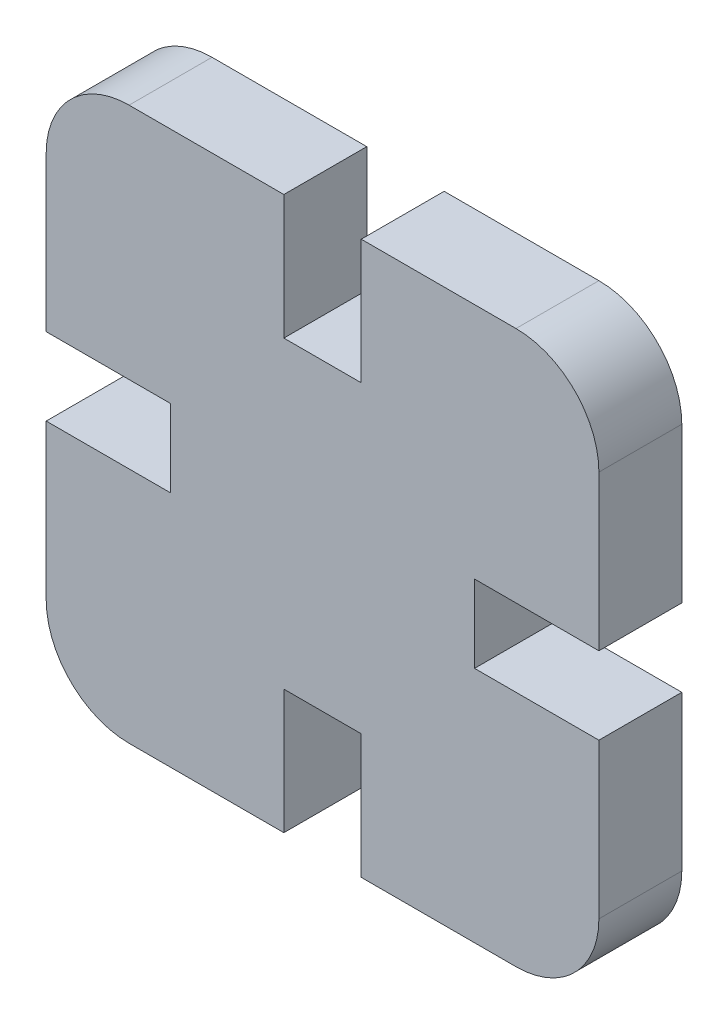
ISO-10303-21;
HEADER;
FILE_DESCRIPTION(('STEP AP214'),'2;1');
FILE_NAME('part.step','',(''),(''),'','','');
FILE_SCHEMA(('AUTOMOTIVE_DESIGN { 1 0 10303 214 1 1 1 1 }'));
ENDSEC;
DATA;
#1=APPLICATION_CONTEXT('core data for automotive mechanical design processes');
#2=APPLICATION_PROTOCOL_DEFINITION('international standard','automotive_design',2000,#1);
#3=PRODUCT_CONTEXT('',#1,'mechanical');
#4=PRODUCT('Part','Part','',(#3));
#5=PRODUCT_RELATED_PRODUCT_CATEGORY('part','',(#4));
#6=PRODUCT_DEFINITION_FORMATION('','',#4);
#7=PRODUCT_DEFINITION_CONTEXT('part definition',#1,'design');
#8=PRODUCT_DEFINITION('design','',#6,#7);
#9=PRODUCT_DEFINITION_SHAPE('','',#8);
#10=(LENGTH_UNIT() NAMED_UNIT(*) SI_UNIT(.MILLI.,.METRE.));
#11=(NAMED_UNIT(*) PLANE_ANGLE_UNIT() SI_UNIT($,.RADIAN.));
#12=(NAMED_UNIT(*) SI_UNIT($,.STERADIAN.) SOLID_ANGLE_UNIT());
#13=UNCERTAINTY_MEASURE_WITH_UNIT(LENGTH_MEASURE(1.E-05),#10,'distance_accuracy_value','');
#14=(GEOMETRIC_REPRESENTATION_CONTEXT(3) GLOBAL_UNCERTAINTY_ASSIGNED_CONTEXT((#13)) GLOBAL_UNIT_ASSIGNED_CONTEXT((#10,
#11,#12)) REPRESENTATION_CONTEXT('',''));
#15=CARTESIAN_POINT('',(0.,0.,0.));
#16=DIRECTION('',(0.,0.,1.));
#17=DIRECTION('',(1.,0.,0.));
#18=AXIS2_PLACEMENT_3D('',#15,#16,#17);
#19=CARTESIAN_POINT('',(-7.,-6.99999999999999,3.));
#20=DIRECTION('',(0.,0.,-1.));
#21=DIRECTION('',(-1.,0.,0.));
#22=AXIS2_PLACEMENT_3D('',#19,#20,#21);
#23=CYLINDRICAL_SURFACE('',#22,3.);
#24=CARTESIAN_POINT('',(-7.,-6.99999999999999,0.));
#25=DIRECTION('',(0.,0.,1.));
#26=DIRECTION('',(1.,0.,0.));
#27=AXIS2_PLACEMENT_3D('',#24,#25,#26);
#28=CIRCLE('',#27,3.);
#29=CARTESIAN_POINT('',(-10.,-6.99999999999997,0.));
#30=VERTEX_POINT('',#29);
#31=CARTESIAN_POINT('',(-6.99999999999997,-9.99999999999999,0.));
#32=VERTEX_POINT('',#31);
#33=EDGE_CURVE('E224',#30,#32,#28,.T.);
#34=ORIENTED_EDGE('',*,*,#33,.T.);
#35=DIRECTION('',(0.,0.,-1.));
#36=VECTOR('',#35,1.);
#37=CARTESIAN_POINT('',(-6.99999999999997,-9.99999999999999,3.));
#38=LINE('',#37,#36);
#39=CARTESIAN_POINT('',(-6.99999999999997,-9.99999999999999,3.));
#40=VERTEX_POINT('',#39);
#41=EDGE_CURVE('E11',#40,#32,#38,.T.);
#42=ORIENTED_EDGE('',*,*,#41,.F.);
#43=CARTESIAN_POINT('',(-7.,-6.99999999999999,3.));
#44=DIRECTION('',(0.,0.,1.));
#45=DIRECTION('',(1.,0.,0.));
#46=AXIS2_PLACEMENT_3D('',#43,#44,#45);
#47=CIRCLE('',#46,3.);
#48=CARTESIAN_POINT('',(-10.,-6.99999999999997,3.));
#49=VERTEX_POINT('',#48);
#50=EDGE_CURVE('E270',#49,#40,#47,.T.);
#51=ORIENTED_EDGE('',*,*,#50,.F.);
#52=DIRECTION('',(0.,0.,-1.));
#53=VECTOR('',#52,1.);
#54=CARTESIAN_POINT('',(-10.,-6.99999999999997,3.));
#55=LINE('',#54,#53);
#56=EDGE_CURVE('E220',#49,#30,#55,.T.);
#57=ORIENTED_EDGE('',*,*,#56,.T.);
#58=EDGE_LOOP('',(#34,#42,#51,#57));
#59=FACE_BOUND('',#58,.T.);
#60=ADVANCED_FACE('F32',(#59),#23,.T.);
#61=CARTESIAN_POINT('',(-6.99999999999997,-9.99999999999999,3.));
#62=DIRECTION('',(0.,1.,0.));
#63=DIRECTION('',(-1.,0.,0.));
#64=AXIS2_PLACEMENT_3D('',#61,#62,#63);
#65=PLANE('',#64);
#66=DIRECTION('',(1.,0.,0.));
#67=VECTOR('',#66,1.);
#68=CARTESIAN_POINT('',(-6.99999999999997,-9.99999999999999,0.));
#69=LINE('',#68,#67);
#70=CARTESIAN_POINT('',(-1.39999999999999,-10.,0.));
#71=VERTEX_POINT('',#70);
#72=EDGE_CURVE('E227',#32,#71,#69,.T.);
#73=ORIENTED_EDGE('',*,*,#72,.T.);
#74=DIRECTION('',(0.,0.,-1.));
#75=VECTOR('',#74,1.);
#76=CARTESIAN_POINT('',(-1.39999999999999,-10.,3.));
#77=LINE('',#76,#75);
#78=CARTESIAN_POINT('',(-1.39999999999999,-10.,3.));
#79=VERTEX_POINT('',#78);
#80=EDGE_CURVE('E40',#79,#71,#77,.T.);
#81=ORIENTED_EDGE('',*,*,#80,.F.);
#82=DIRECTION('',(1.,0.,0.));
#83=VECTOR('',#82,1.);
#84=CARTESIAN_POINT('',(-6.99999999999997,-9.99999999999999,3.));
#85=LINE('',#84,#83);
#86=EDGE_CURVE('E139',#40,#79,#85,.T.);
#87=ORIENTED_EDGE('',*,*,#86,.F.);
#88=ORIENTED_EDGE('',*,*,#41,.T.);
#89=EDGE_LOOP('',(#73,#81,#87,#88));
#90=FACE_BOUND('',#89,.T.);
#91=ADVANCED_FACE('F408',(#90),#65,.F.);
#92=CARTESIAN_POINT('',(-1.39999999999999,-10.,3.));
#93=DIRECTION('',(-1.,0.,0.));
#94=DIRECTION('',(0.,-1.,0.));
#95=AXIS2_PLACEMENT_3D('',#92,#93,#94);
#96=PLANE('',#95);
#97=DIRECTION('',(0.,1.,0.));
#98=VECTOR('',#97,1.);
#99=CARTESIAN_POINT('',(-1.39999999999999,-10.,0.));
#100=LINE('',#99,#98);
#101=CARTESIAN_POINT('',(-1.39999999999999,-5.5,0.));
#102=VERTEX_POINT('',#101);
#103=EDGE_CURVE('E229',#71,#102,#100,.T.);
#104=ORIENTED_EDGE('',*,*,#103,.T.);
#105=DIRECTION('',(0.,0.,-1.));
#106=VECTOR('',#105,1.);
#107=CARTESIAN_POINT('',(-1.39999999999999,-5.5,3.));
#108=LINE('',#107,#106);
#109=CARTESIAN_POINT('',(-1.39999999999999,-5.5,3.));
#110=VERTEX_POINT('',#109);
#111=EDGE_CURVE('E325',#110,#102,#108,.T.);
#112=ORIENTED_EDGE('',*,*,#111,.F.);
#113=DIRECTION('',(0.,1.,0.));
#114=VECTOR('',#113,1.);
#115=CARTESIAN_POINT('',(-1.39999999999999,-10.,3.));
#116=LINE('',#115,#114);
#117=EDGE_CURVE('E333',#79,#110,#116,.T.);
#118=ORIENTED_EDGE('',*,*,#117,.F.);
#119=ORIENTED_EDGE('',*,*,#80,.T.);
#120=EDGE_LOOP('',(#104,#112,#118,#119));
#121=FACE_BOUND('',#120,.T.);
#122=ADVANCED_FACE('F331',(#121),#96,.F.);
#123=CARTESIAN_POINT('',(-1.39999999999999,-5.5,3.));
#124=DIRECTION('',(0.,1.,0.));
#125=DIRECTION('',(0.,0.,1.));
#126=AXIS2_PLACEMENT_3D('',#123,#124,#125);
#127=PLANE('',#126);
#128=DIRECTION('',(1.,0.,0.));
#129=VECTOR('',#128,1.);
#130=CARTESIAN_POINT('',(-1.39999999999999,-5.5,0.));
#131=LINE('',#130,#129);
#132=CARTESIAN_POINT('',(1.40000000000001,-5.5,0.));
#133=VERTEX_POINT('',#132);
#134=EDGE_CURVE('E231',#102,#133,#131,.T.);
#135=ORIENTED_EDGE('',*,*,#134,.T.);
#136=DIRECTION('',(0.,0.,-1.));
#137=VECTOR('',#136,1.);
#138=CARTESIAN_POINT('',(1.40000000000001,-5.5,3.));
#139=LINE('',#138,#137);
#140=CARTESIAN_POINT('',(1.40000000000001,-5.5,3.));
#141=VERTEX_POINT('',#140);
#142=EDGE_CURVE('E322',#141,#133,#139,.T.);
#143=ORIENTED_EDGE('',*,*,#142,.F.);
#144=DIRECTION('',(1.,0.,0.));
#145=VECTOR('',#144,1.);
#146=CARTESIAN_POINT('',(-1.39999999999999,-5.5,3.));
#147=LINE('',#146,#145);
#148=EDGE_CURVE('E351',#110,#141,#147,.T.);
#149=ORIENTED_EDGE('',*,*,#148,.F.);
#150=ORIENTED_EDGE('',*,*,#111,.T.);
#151=EDGE_LOOP('',(#135,#143,#149,#150));
#152=FACE_BOUND('',#151,.T.);
#153=ADVANCED_FACE('F342',(#152),#127,.F.);
#154=CARTESIAN_POINT('',(1.40000000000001,-5.5,3.));
#155=DIRECTION('',(1.,0.,0.));
#156=DIRECTION('',(0.,1.,0.));
#157=AXIS2_PLACEMENT_3D('',#154,#155,#156);
#158=PLANE('',#157);
#159=DIRECTION('',(0.,-1.,0.));
#160=VECTOR('',#159,1.);
#161=CARTESIAN_POINT('',(1.40000000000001,-5.5,0.));
#162=LINE('',#161,#160);
#163=CARTESIAN_POINT('',(1.4,-10.,0.));
#164=VERTEX_POINT('',#163);
#165=EDGE_CURVE('E233',#133,#164,#162,.T.);
#166=ORIENTED_EDGE('',*,*,#165,.T.);
#167=DIRECTION('',(0.,0.,-1.));
#168=VECTOR('',#167,1.);
#169=CARTESIAN_POINT('',(1.4,-10.,3.));
#170=LINE('',#169,#168);
#171=CARTESIAN_POINT('',(1.4,-10.,3.));
#172=VERTEX_POINT('',#171);
#173=EDGE_CURVE('E319',#172,#164,#170,.T.);
#174=ORIENTED_EDGE('',*,*,#173,.F.);
#175=DIRECTION('',(0.,-1.,0.));
#176=VECTOR('',#175,1.);
#177=CARTESIAN_POINT('',(1.40000000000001,-5.5,3.));
#178=LINE('',#177,#176);
#179=EDGE_CURVE('E348',#141,#172,#178,.T.);
#180=ORIENTED_EDGE('',*,*,#179,.F.);
#181=ORIENTED_EDGE('',*,*,#142,.T.);
#182=EDGE_LOOP('',(#166,#174,#180,#181));
#183=FACE_BOUND('',#182,.T.);
#184=ADVANCED_FACE('F346',(#183),#158,.F.);
#185=CARTESIAN_POINT('',(1.4,-10.,3.));
#186=DIRECTION('',(0.,1.,0.));
#187=DIRECTION('',(-1.,0.,0.));
#188=AXIS2_PLACEMENT_3D('',#185,#186,#187);
#189=PLANE('',#188);
#190=DIRECTION('',(1.,0.,0.));
#191=VECTOR('',#190,1.);
#192=CARTESIAN_POINT('',(1.4,-10.,0.));
#193=LINE('',#192,#191);
#194=CARTESIAN_POINT('',(6.99999999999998,-10.,0.));
#195=VERTEX_POINT('',#194);
#196=EDGE_CURVE('E235',#164,#195,#193,.T.);
#197=ORIENTED_EDGE('',*,*,#196,.T.);
#198=DIRECTION('',(0.,0.,-1.));
#199=VECTOR('',#198,1.);
#200=CARTESIAN_POINT('',(6.99999999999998,-10.,3.));
#201=LINE('',#200,#199);
#202=CARTESIAN_POINT('',(6.99999999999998,-10.,3.));
#203=VERTEX_POINT('',#202);
#204=EDGE_CURVE('E316',#203,#195,#201,.T.);
#205=ORIENTED_EDGE('',*,*,#204,.F.);
#206=DIRECTION('',(1.,0.,0.));
#207=VECTOR('',#206,1.);
#208=CARTESIAN_POINT('',(1.4,-10.,3.));
#209=LINE('',#208,#207);
#210=EDGE_CURVE('E350',#172,#203,#209,.T.);
#211=ORIENTED_EDGE('',*,*,#210,.F.);
#212=ORIENTED_EDGE('',*,*,#173,.T.);
#213=EDGE_LOOP('',(#197,#205,#211,#212));
#214=FACE_BOUND('',#213,.T.);
#215=ADVANCED_FACE('F421',(#214),#189,.F.);
#216=CARTESIAN_POINT('',(7.,-7.00000000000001,3.));
#217=DIRECTION('',(0.,0.,-1.));
#218=DIRECTION('',(-1.,0.,0.));
#219=AXIS2_PLACEMENT_3D('',#216,#217,#218);
#220=CYLINDRICAL_SURFACE('',#219,3.);
#221=CARTESIAN_POINT('',(7.,-7.00000000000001,0.));
#222=DIRECTION('',(0.,0.,1.));
#223=DIRECTION('',(1.,0.,0.));
#224=AXIS2_PLACEMENT_3D('',#221,#222,#223);
#225=CIRCLE('',#224,3.);
#226=CARTESIAN_POINT('',(9.99999999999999,-6.99999999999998,0.));
#227=VERTEX_POINT('',#226);
#228=EDGE_CURVE('E237',#195,#227,#225,.T.);
#229=ORIENTED_EDGE('',*,*,#228,.T.);
#230=DIRECTION('',(0.,0.,-1.));
#231=VECTOR('',#230,1.);
#232=CARTESIAN_POINT('',(9.99999999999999,-6.99999999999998,3.));
#233=LINE('',#232,#231);
#234=CARTESIAN_POINT('',(9.99999999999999,-6.99999999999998,3.));
#235=VERTEX_POINT('',#234);
#236=EDGE_CURVE('E313',#235,#227,#233,.T.);
#237=ORIENTED_EDGE('',*,*,#236,.F.);
#238=CARTESIAN_POINT('',(7.,-7.00000000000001,3.));
#239=DIRECTION('',(0.,0.,1.));
#240=DIRECTION('',(1.,0.,0.));
#241=AXIS2_PLACEMENT_3D('',#238,#239,#240);
#242=CIRCLE('',#241,3.);
#243=EDGE_CURVE('E353',#203,#235,#242,.T.);
#244=ORIENTED_EDGE('',*,*,#243,.F.);
#245=ORIENTED_EDGE('',*,*,#204,.T.);
#246=EDGE_LOOP('',(#229,#237,#244,#245));
#247=FACE_BOUND('',#246,.T.);
#248=ADVANCED_FACE('F424',(#247),#220,.T.);
#249=CARTESIAN_POINT('',(9.99999999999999,-6.99999999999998,3.));
#250=DIRECTION('',(-1.,0.,0.));
#251=DIRECTION('',(0.,-1.,0.));
#252=AXIS2_PLACEMENT_3D('',#249,#250,#251);
#253=PLANE('',#252);
#254=DIRECTION('',(0.,1.,0.));
#255=VECTOR('',#254,1.);
#256=CARTESIAN_POINT('',(9.99999999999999,-6.99999999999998,0.));
#257=LINE('',#256,#255);
#258=CARTESIAN_POINT('',(10.,-1.39999999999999,0.));
#259=VERTEX_POINT('',#258);
#260=EDGE_CURVE('E239',#227,#259,#257,.T.);
#261=ORIENTED_EDGE('',*,*,#260,.T.);
#262=DIRECTION('',(0.,0.,-1.));
#263=VECTOR('',#262,1.);
#264=CARTESIAN_POINT('',(10.,-1.39999999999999,3.));
#265=LINE('',#264,#263);
#266=CARTESIAN_POINT('',(10.,-1.39999999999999,3.));
#267=VERTEX_POINT('',#266);
#268=EDGE_CURVE('E310',#267,#259,#265,.T.);
#269=ORIENTED_EDGE('',*,*,#268,.F.);
#270=DIRECTION('',(0.,1.,0.));
#271=VECTOR('',#270,1.);
#272=CARTESIAN_POINT('',(9.99999999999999,-6.99999999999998,3.));
#273=LINE('',#272,#271);
#274=EDGE_CURVE('E359',#235,#267,#273,.T.);
#275=ORIENTED_EDGE('',*,*,#274,.F.);
#276=ORIENTED_EDGE('',*,*,#236,.T.);
#277=EDGE_LOOP('',(#261,#269,#275,#276));
#278=FACE_BOUND('',#277,.T.);
#279=ADVANCED_FACE('F428',(#278),#253,.F.);
#280=CARTESIAN_POINT('',(10.,-1.39999999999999,3.));
#281=DIRECTION('',(0.,-1.,0.));
#282=DIRECTION('',(1.,0.,0.));
#283=AXIS2_PLACEMENT_3D('',#280,#281,#282);
#284=PLANE('',#283);
#285=DIRECTION('',(-1.,0.,0.));
#286=VECTOR('',#285,1.);
#287=CARTESIAN_POINT('',(10.,-1.39999999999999,0.));
#288=LINE('',#287,#286);
#289=CARTESIAN_POINT('',(5.5,-1.39999999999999,0.));
#290=VERTEX_POINT('',#289);
#291=EDGE_CURVE('E241',#259,#290,#288,.T.);
#292=ORIENTED_EDGE('',*,*,#291,.T.);
#293=DIRECTION('',(0.,0.,-1.));
#294=VECTOR('',#293,1.);
#295=CARTESIAN_POINT('',(5.5,-1.39999999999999,3.));
#296=LINE('',#295,#294);
#297=CARTESIAN_POINT('',(5.5,-1.39999999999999,3.));
#298=VERTEX_POINT('',#297);
#299=EDGE_CURVE('E307',#298,#290,#296,.T.);
#300=ORIENTED_EDGE('',*,*,#299,.F.);
#301=DIRECTION('',(-1.,0.,0.));
#302=VECTOR('',#301,1.);
#303=CARTESIAN_POINT('',(10.,-1.39999999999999,3.));
#304=LINE('',#303,#302);
#305=EDGE_CURVE('E361',#267,#298,#304,.T.);
#306=ORIENTED_EDGE('',*,*,#305,.F.);
#307=ORIENTED_EDGE('',*,*,#268,.T.);
#308=EDGE_LOOP('',(#292,#300,#306,#307));
#309=FACE_BOUND('',#308,.T.);
#310=ADVANCED_FACE('F432',(#309),#284,.F.);
#311=CARTESIAN_POINT('',(5.5,-1.39999999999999,3.));
#312=DIRECTION('',(-1.,0.,0.));
#313=DIRECTION('',(0.,0.,1.));
#314=AXIS2_PLACEMENT_3D('',#311,#312,#313);
#315=PLANE('',#314);
#316=DIRECTION('',(0.,1.,0.));
#317=VECTOR('',#316,1.);
#318=CARTESIAN_POINT('',(5.5,-1.39999999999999,0.));
#319=LINE('',#318,#317);
#320=CARTESIAN_POINT('',(5.5,1.40000000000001,0.));
#321=VERTEX_POINT('',#320);
#322=EDGE_CURVE('E243',#290,#321,#319,.T.);
#323=ORIENTED_EDGE('',*,*,#322,.T.);
#324=DIRECTION('',(0.,0.,-1.));
#325=VECTOR('',#324,1.);
#326=CARTESIAN_POINT('',(5.5,1.40000000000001,3.));
#327=LINE('',#326,#325);
#328=CARTESIAN_POINT('',(5.5,1.40000000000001,3.));
#329=VERTEX_POINT('',#328);
#330=EDGE_CURVE('E304',#329,#321,#327,.T.);
#331=ORIENTED_EDGE('',*,*,#330,.F.);
#332=DIRECTION('',(0.,1.,0.));
#333=VECTOR('',#332,1.);
#334=CARTESIAN_POINT('',(5.5,-1.39999999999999,3.));
#335=LINE('',#334,#333);
#336=EDGE_CURVE('E363',#298,#329,#335,.T.);
#337=ORIENTED_EDGE('',*,*,#336,.F.);
#338=ORIENTED_EDGE('',*,*,#299,.T.);
#339=EDGE_LOOP('',(#323,#331,#337,#338));
#340=FACE_BOUND('',#339,.T.);
#341=ADVANCED_FACE('F436',(#340),#315,.F.);
#342=CARTESIAN_POINT('',(5.5,1.40000000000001,3.));
#343=DIRECTION('',(0.,1.,0.));
#344=DIRECTION('',(-1.,0.,0.));
#345=AXIS2_PLACEMENT_3D('',#342,#343,#344);
#346=PLANE('',#345);
#347=DIRECTION('',(1.,0.,0.));
#348=VECTOR('',#347,1.);
#349=CARTESIAN_POINT('',(5.5,1.40000000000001,0.));
#350=LINE('',#349,#348);
#351=CARTESIAN_POINT('',(10.,1.40000000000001,0.));
#352=VERTEX_POINT('',#351);
#353=EDGE_CURVE('E245',#321,#352,#350,.T.);
#354=ORIENTED_EDGE('',*,*,#353,.T.);
#355=DIRECTION('',(0.,0.,-1.));
#356=VECTOR('',#355,1.);
#357=CARTESIAN_POINT('',(10.,1.40000000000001,3.));
#358=LINE('',#357,#356);
#359=CARTESIAN_POINT('',(10.,1.40000000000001,3.));
#360=VERTEX_POINT('',#359);
#361=EDGE_CURVE('E301',#360,#352,#358,.T.);
#362=ORIENTED_EDGE('',*,*,#361,.F.);
#363=DIRECTION('',(1.,0.,0.));
#364=VECTOR('',#363,1.);
#365=CARTESIAN_POINT('',(5.5,1.40000000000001,3.));
#366=LINE('',#365,#364);
#367=EDGE_CURVE('E365',#329,#360,#366,.T.);
#368=ORIENTED_EDGE('',*,*,#367,.F.);
#369=ORIENTED_EDGE('',*,*,#330,.T.);
#370=EDGE_LOOP('',(#354,#362,#368,#369));
#371=FACE_BOUND('',#370,.T.);
#372=ADVANCED_FACE('F440',(#371),#346,.F.);
#373=CARTESIAN_POINT('',(10.,1.40000000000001,3.));
#374=DIRECTION('',(-1.,0.,0.));
#375=DIRECTION('',(0.,-1.,0.));
#376=AXIS2_PLACEMENT_3D('',#373,#374,#375);
#377=PLANE('',#376);
#378=DIRECTION('',(0.,1.,0.));
#379=VECTOR('',#378,1.);
#380=CARTESIAN_POINT('',(10.,1.40000000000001,0.));
#381=LINE('',#380,#379);
#382=CARTESIAN_POINT('',(10.,6.99999999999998,0.));
#383=VERTEX_POINT('',#382);
#384=EDGE_CURVE('E247',#352,#383,#381,.T.);
#385=ORIENTED_EDGE('',*,*,#384,.T.);
#386=DIRECTION('',(0.,0.,-1.));
#387=VECTOR('',#386,1.);
#388=CARTESIAN_POINT('',(10.,6.99999999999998,3.));
#389=LINE('',#388,#387);
#390=CARTESIAN_POINT('',(10.,6.99999999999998,3.));
#391=VERTEX_POINT('',#390);
#392=EDGE_CURVE('E298',#391,#383,#389,.T.);
#393=ORIENTED_EDGE('',*,*,#392,.F.);
#394=DIRECTION('',(0.,1.,0.));
#395=VECTOR('',#394,1.);
#396=CARTESIAN_POINT('',(10.,1.40000000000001,3.));
#397=LINE('',#396,#395);
#398=EDGE_CURVE('E367',#360,#391,#397,.T.);
#399=ORIENTED_EDGE('',*,*,#398,.F.);
#400=ORIENTED_EDGE('',*,*,#361,.T.);
#401=EDGE_LOOP('',(#385,#393,#399,#400));
#402=FACE_BOUND('',#401,.T.);
#403=ADVANCED_FACE('F444',(#402),#377,.F.);
#404=CARTESIAN_POINT('',(7.00000000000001,7.,3.));
#405=DIRECTION('',(0.,0.,-1.));
#406=DIRECTION('',(-1.,0.,0.));
#407=AXIS2_PLACEMENT_3D('',#404,#405,#406);
#408=CYLINDRICAL_SURFACE('',#407,3.);
#409=CARTESIAN_POINT('',(7.00000000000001,7.,0.));
#410=DIRECTION('',(0.,0.,1.));
#411=DIRECTION('',(1.,0.,0.));
#412=AXIS2_PLACEMENT_3D('',#409,#410,#411);
#413=CIRCLE('',#412,3.);
#414=CARTESIAN_POINT('',(6.99999999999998,10.,0.));
#415=VERTEX_POINT('',#414);
#416=EDGE_CURVE('E249',#383,#415,#413,.T.);
#417=ORIENTED_EDGE('',*,*,#416,.T.);
#418=DIRECTION('',(0.,0.,-1.));
#419=VECTOR('',#418,1.);
#420=CARTESIAN_POINT('',(6.99999999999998,10.,3.));
#421=LINE('',#420,#419);
#422=CARTESIAN_POINT('',(6.99999999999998,10.,3.));
#423=VERTEX_POINT('',#422);
#424=EDGE_CURVE('E295',#423,#415,#421,.T.);
#425=ORIENTED_EDGE('',*,*,#424,.F.);
#426=CARTESIAN_POINT('',(7.00000000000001,7.,3.));
#427=DIRECTION('',(0.,0.,1.));
#428=DIRECTION('',(1.,0.,0.));
#429=AXIS2_PLACEMENT_3D('',#426,#427,#428);
#430=CIRCLE('',#429,3.);
#431=EDGE_CURVE('E369',#391,#423,#430,.T.);
#432=ORIENTED_EDGE('',*,*,#431,.F.);
#433=ORIENTED_EDGE('',*,*,#392,.T.);
#434=EDGE_LOOP('',(#417,#425,#432,#433));
#435=FACE_BOUND('',#434,.T.);
#436=ADVANCED_FACE('F448',(#435),#408,.T.);
#437=CARTESIAN_POINT('',(1.4,10.,3.));
#438=DIRECTION('',(0.,-1.,0.));
#439=DIRECTION('',(1.,0.,0.));
#440=AXIS2_PLACEMENT_3D('',#437,#438,#439);
#441=PLANE('',#440);
#442=DIRECTION('',(-1.,0.,0.));
#443=VECTOR('',#442,1.);
#444=CARTESIAN_POINT('',(1.4,10.,0.));
#445=LINE('',#444,#443);
#446=CARTESIAN_POINT('',(1.4,10.,0.));
#447=VERTEX_POINT('',#446);
#448=EDGE_CURVE('E251',#415,#447,#445,.T.);
#449=ORIENTED_EDGE('',*,*,#448,.T.);
#450=DIRECTION('',(0.,0.,-1.));
#451=VECTOR('',#450,1.);
#452=CARTESIAN_POINT('',(1.4,10.,3.));
#453=LINE('',#452,#451);
#454=CARTESIAN_POINT('',(1.4,10.,3.));
#455=VERTEX_POINT('',#454);
#456=EDGE_CURVE('E292',#455,#447,#453,.T.);
#457=ORIENTED_EDGE('',*,*,#456,.F.);
#458=DIRECTION('',(-1.,0.,0.));
#459=VECTOR('',#458,1.);
#460=CARTESIAN_POINT('',(1.4,10.,3.));
#461=LINE('',#460,#459);
#462=EDGE_CURVE('E371',#423,#455,#461,.T.);
#463=ORIENTED_EDGE('',*,*,#462,.F.);
#464=ORIENTED_EDGE('',*,*,#424,.T.);
#465=EDGE_LOOP('',(#449,#457,#463,#464));
#466=FACE_BOUND('',#465,.T.);
#467=ADVANCED_FACE('F452',(#466),#441,.F.);
#468=CARTESIAN_POINT('',(1.4,10.,3.));
#469=DIRECTION('',(1.,0.,0.));
#470=DIRECTION('',(0.,1.,0.));
#471=AXIS2_PLACEMENT_3D('',#468,#469,#470);
#472=PLANE('',#471);
#473=DIRECTION('',(0.,-1.,0.));
#474=VECTOR('',#473,1.);
#475=CARTESIAN_POINT('',(1.4,10.,0.));
#476=LINE('',#475,#474);
#477=CARTESIAN_POINT('',(1.4,5.50000000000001,0.));
#478=VERTEX_POINT('',#477);
#479=EDGE_CURVE('E253',#447,#478,#476,.T.);
#480=ORIENTED_EDGE('',*,*,#479,.T.);
#481=DIRECTION('',(0.,0.,-1.));
#482=VECTOR('',#481,1.);
#483=CARTESIAN_POINT('',(1.4,5.50000000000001,3.));
#484=LINE('',#483,#482);
#485=CARTESIAN_POINT('',(1.4,5.50000000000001,3.));
#486=VERTEX_POINT('',#485);
#487=EDGE_CURVE('E289',#486,#478,#484,.T.);
#488=ORIENTED_EDGE('',*,*,#487,.F.);
#489=DIRECTION('',(0.,-1.,0.));
#490=VECTOR('',#489,1.);
#491=CARTESIAN_POINT('',(1.4,10.,3.));
#492=LINE('',#491,#490);
#493=EDGE_CURVE('E373',#455,#486,#492,.T.);
#494=ORIENTED_EDGE('',*,*,#493,.F.);
#495=ORIENTED_EDGE('',*,*,#456,.T.);
#496=EDGE_LOOP('',(#480,#488,#494,#495));
#497=FACE_BOUND('',#496,.T.);
#498=ADVANCED_FACE('F456',(#497),#472,.F.);
#499=CARTESIAN_POINT('',(1.4,5.50000000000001,3.));
#500=DIRECTION('',(0.,-1.,0.));
#501=DIRECTION('',(0.,0.,-1.));
#502=AXIS2_PLACEMENT_3D('',#499,#500,#501);
#503=PLANE('',#502);
#504=DIRECTION('',(-1.,0.,0.));
#505=VECTOR('',#504,1.);
#506=CARTESIAN_POINT('',(1.4,5.50000000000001,0.));
#507=LINE('',#506,#505);
#508=CARTESIAN_POINT('',(-1.4,5.50000000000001,0.));
#509=VERTEX_POINT('',#508);
#510=EDGE_CURVE('E255',#478,#509,#507,.T.);
#511=ORIENTED_EDGE('',*,*,#510,.T.);
#512=DIRECTION('',(0.,0.,-1.));
#513=VECTOR('',#512,1.);
#514=CARTESIAN_POINT('',(-1.4,5.50000000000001,3.));
#515=LINE('',#514,#513);
#516=CARTESIAN_POINT('',(-1.4,5.50000000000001,3.));
#517=VERTEX_POINT('',#516);
#518=EDGE_CURVE('E286',#517,#509,#515,.T.);
#519=ORIENTED_EDGE('',*,*,#518,.F.);
#520=DIRECTION('',(-1.,0.,0.));
#521=VECTOR('',#520,1.);
#522=CARTESIAN_POINT('',(1.4,5.50000000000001,3.));
#523=LINE('',#522,#521);
#524=EDGE_CURVE('E375',#486,#517,#523,.T.);
#525=ORIENTED_EDGE('',*,*,#524,.F.);
#526=ORIENTED_EDGE('',*,*,#487,.T.);
#527=EDGE_LOOP('',(#511,#519,#525,#526));
#528=FACE_BOUND('',#527,.T.);
#529=ADVANCED_FACE('F460',(#528),#503,.F.);
#530=CARTESIAN_POINT('',(-1.4,5.50000000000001,3.));
#531=DIRECTION('',(-1.,0.,0.));
#532=DIRECTION('',(0.,-1.,0.));
#533=AXIS2_PLACEMENT_3D('',#530,#531,#532);
#534=PLANE('',#533);
#535=DIRECTION('',(0.,1.,0.));
#536=VECTOR('',#535,1.);
#537=CARTESIAN_POINT('',(-1.4,5.50000000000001,0.));
#538=LINE('',#537,#536);
#539=CARTESIAN_POINT('',(-1.4,10.,0.));
#540=VERTEX_POINT('',#539);
#541=EDGE_CURVE('E257',#509,#540,#538,.T.);
#542=ORIENTED_EDGE('',*,*,#541,.T.);
#543=DIRECTION('',(0.,0.,-1.));
#544=VECTOR('',#543,1.);
#545=CARTESIAN_POINT('',(-1.4,10.,3.));
#546=LINE('',#545,#544);
#547=CARTESIAN_POINT('',(-1.4,10.,3.));
#548=VERTEX_POINT('',#547);
#549=EDGE_CURVE('E283',#548,#540,#546,.T.);
#550=ORIENTED_EDGE('',*,*,#549,.F.);
#551=DIRECTION('',(0.,1.,0.));
#552=VECTOR('',#551,1.);
#553=CARTESIAN_POINT('',(-1.4,5.50000000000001,3.));
#554=LINE('',#553,#552);
#555=EDGE_CURVE('E377',#517,#548,#554,.T.);
#556=ORIENTED_EDGE('',*,*,#555,.F.);
#557=ORIENTED_EDGE('',*,*,#518,.T.);
#558=EDGE_LOOP('',(#542,#550,#556,#557));
#559=FACE_BOUND('',#558,.T.);
#560=ADVANCED_FACE('F464',(#559),#534,.F.);
#561=CARTESIAN_POINT('',(-6.99999999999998,10.,3.));
#562=DIRECTION('',(0.,-1.,0.));
#563=DIRECTION('',(0.,0.,-1.));
#564=AXIS2_PLACEMENT_3D('',#561,#562,#563);
#565=PLANE('',#564);
#566=DIRECTION('',(-1.,0.,0.));
#567=VECTOR('',#566,1.);
#568=CARTESIAN_POINT('',(-6.99999999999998,10.,0.));
#569=LINE('',#568,#567);
#570=CARTESIAN_POINT('',(-6.99999999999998,10.,0.));
#571=VERTEX_POINT('',#570);
#572=EDGE_CURVE('E259',#540,#571,#569,.T.);
#573=ORIENTED_EDGE('',*,*,#572,.T.);
#574=DIRECTION('',(0.,0.,-1.));
#575=VECTOR('',#574,1.);
#576=CARTESIAN_POINT('',(-6.99999999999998,10.,3.));
#577=LINE('',#576,#575);
#578=CARTESIAN_POINT('',(-6.99999999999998,10.,3.));
#579=VERTEX_POINT('',#578);
#580=EDGE_CURVE('E280',#579,#571,#577,.T.);
#581=ORIENTED_EDGE('',*,*,#580,.F.);
#582=DIRECTION('',(-1.,0.,0.));
#583=VECTOR('',#582,1.);
#584=CARTESIAN_POINT('',(-6.99999999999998,10.,3.));
#585=LINE('',#584,#583);
#586=EDGE_CURVE('E379',#548,#579,#585,.T.);
#587=ORIENTED_EDGE('',*,*,#586,.F.);
#588=ORIENTED_EDGE('',*,*,#549,.T.);
#589=EDGE_LOOP('',(#573,#581,#587,#588));
#590=FACE_BOUND('',#589,.T.);
#591=ADVANCED_FACE('F468',(#590),#565,.F.);
#592=CARTESIAN_POINT('',(-7.,7.,3.));
#593=DIRECTION('',(0.,0.,-1.));
#594=DIRECTION('',(-1.,0.,0.));
#595=AXIS2_PLACEMENT_3D('',#592,#593,#594);
#596=CYLINDRICAL_SURFACE('',#595,3.);
#597=CARTESIAN_POINT('',(-7.,7.,0.));
#598=DIRECTION('',(0.,0.,1.));
#599=DIRECTION('',(1.,0.,0.));
#600=AXIS2_PLACEMENT_3D('',#597,#598,#599);
#601=CIRCLE('',#600,3.);
#602=CARTESIAN_POINT('',(-10.,6.99999999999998,0.));
#603=VERTEX_POINT('',#602);
#604=EDGE_CURVE('E261',#571,#603,#601,.T.);
#605=ORIENTED_EDGE('',*,*,#604,.T.);
#606=DIRECTION('',(0.,0.,-1.));
#607=VECTOR('',#606,1.);
#608=CARTESIAN_POINT('',(-10.,6.99999999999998,3.));
#609=LINE('',#608,#607);
#610=CARTESIAN_POINT('',(-10.,6.99999999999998,3.));
#611=VERTEX_POINT('',#610);
#612=EDGE_CURVE('E277',#611,#603,#609,.T.);
#613=ORIENTED_EDGE('',*,*,#612,.F.);
#614=CARTESIAN_POINT('',(-7.,7.,3.));
#615=DIRECTION('',(0.,0.,1.));
#616=DIRECTION('',(1.,0.,0.));
#617=AXIS2_PLACEMENT_3D('',#614,#615,#616);
#618=CIRCLE('',#617,3.);
#619=EDGE_CURVE('E381',#579,#611,#618,.T.);
#620=ORIENTED_EDGE('',*,*,#619,.F.);
#621=ORIENTED_EDGE('',*,*,#580,.T.);
#622=EDGE_LOOP('',(#605,#613,#620,#621));
#623=FACE_BOUND('',#622,.T.);
#624=ADVANCED_FACE('F472',(#623),#596,.T.);
#625=CARTESIAN_POINT('',(-10.,1.4,3.));
#626=DIRECTION('',(1.,0.,0.));
#627=DIRECTION('',(0.,0.,-1.));
#628=AXIS2_PLACEMENT_3D('',#625,#626,#627);
#629=PLANE('',#628);
#630=DIRECTION('',(0.,-1.,0.));
#631=VECTOR('',#630,1.);
#632=CARTESIAN_POINT('',(-10.,1.4,0.));
#633=LINE('',#632,#631);
#634=CARTESIAN_POINT('',(-10.,1.4,0.));
#635=VERTEX_POINT('',#634);
#636=EDGE_CURVE('E263',#603,#635,#633,.T.);
#637=ORIENTED_EDGE('',*,*,#636,.T.);
#638=DIRECTION('',(0.,0.,-1.));
#639=VECTOR('',#638,1.);
#640=CARTESIAN_POINT('',(-10.,1.4,3.));
#641=LINE('',#640,#639);
#642=CARTESIAN_POINT('',(-10.,1.4,3.));
#643=VERTEX_POINT('',#642);
#644=EDGE_CURVE('E274',#643,#635,#641,.T.);
#645=ORIENTED_EDGE('',*,*,#644,.F.);
#646=DIRECTION('',(0.,-1.,0.));
#647=VECTOR('',#646,1.);
#648=CARTESIAN_POINT('',(-10.,1.4,3.));
#649=LINE('',#648,#647);
#650=EDGE_CURVE('E383',#611,#643,#649,.T.);
#651=ORIENTED_EDGE('',*,*,#650,.F.);
#652=ORIENTED_EDGE('',*,*,#612,.T.);
#653=EDGE_LOOP('',(#637,#645,#651,#652));
#654=FACE_BOUND('',#653,.T.);
#655=ADVANCED_FACE('F389',(#654),#629,.F.);
#656=CARTESIAN_POINT('',(-10.,1.4,3.));
#657=DIRECTION('',(0.,1.,0.));
#658=DIRECTION('',(0.,0.,1.));
#659=AXIS2_PLACEMENT_3D('',#656,#657,#658);
#660=PLANE('',#659);
#661=DIRECTION('',(1.,0.,0.));
#662=VECTOR('',#661,1.);
#663=CARTESIAN_POINT('',(-10.,1.4,0.));
#664=LINE('',#663,#662);
#665=CARTESIAN_POINT('',(-5.5,1.4,0.));
#666=VERTEX_POINT('',#665);
#667=EDGE_CURVE('E265',#635,#666,#664,.T.);
#668=ORIENTED_EDGE('',*,*,#667,.T.);
#669=DIRECTION('',(0.,0.,-1.));
#670=VECTOR('',#669,1.);
#671=CARTESIAN_POINT('',(-5.5,1.4,3.));
#672=LINE('',#671,#670);
#673=CARTESIAN_POINT('',(-5.5,1.4,3.));
#674=VERTEX_POINT('',#673);
#675=EDGE_CURVE('E215',#674,#666,#672,.T.);
#676=ORIENTED_EDGE('',*,*,#675,.F.);
#677=DIRECTION('',(1.,0.,0.));
#678=VECTOR('',#677,1.);
#679=CARTESIAN_POINT('',(-10.,1.4,3.));
#680=LINE('',#679,#678);
#681=EDGE_CURVE('E206',#643,#674,#680,.T.);
#682=ORIENTED_EDGE('',*,*,#681,.F.);
#683=ORIENTED_EDGE('',*,*,#644,.T.);
#684=EDGE_LOOP('',(#668,#676,#682,#683));
#685=FACE_BOUND('',#684,.T.);
#686=ADVANCED_FACE('F393',(#685),#660,.F.);
#687=CARTESIAN_POINT('',(-5.5,1.4,3.));
#688=DIRECTION('',(1.,0.,0.));
#689=DIRECTION('',(0.,0.,-1.));
#690=AXIS2_PLACEMENT_3D('',#687,#688,#689);
#691=PLANE('',#690);
#692=DIRECTION('',(0.,-1.,0.));
#693=VECTOR('',#692,1.);
#694=CARTESIAN_POINT('',(-5.5,1.4,0.));
#695=LINE('',#694,#693);
#696=CARTESIAN_POINT('',(-5.5,-1.4,0.));
#697=VERTEX_POINT('',#696);
#698=EDGE_CURVE('E214',#666,#697,#695,.T.);
#699=ORIENTED_EDGE('',*,*,#698,.T.);
#700=DIRECTION('',(0.,0.,-1.));
#701=VECTOR('',#700,1.);
#702=CARTESIAN_POINT('',(-5.5,-1.4,3.));
#703=LINE('',#702,#701);
#704=CARTESIAN_POINT('',(-5.5,-1.4,3.));
#705=VERTEX_POINT('',#704);
#706=EDGE_CURVE('E211',#705,#697,#703,.T.);
#707=ORIENTED_EDGE('',*,*,#706,.F.);
#708=DIRECTION('',(0.,-1.,0.));
#709=VECTOR('',#708,1.);
#710=CARTESIAN_POINT('',(-5.5,1.4,3.));
#711=LINE('',#710,#709);
#712=EDGE_CURVE('E200',#674,#705,#711,.T.);
#713=ORIENTED_EDGE('',*,*,#712,.F.);
#714=ORIENTED_EDGE('',*,*,#675,.T.);
#715=EDGE_LOOP('',(#699,#707,#713,#714));
#716=FACE_BOUND('',#715,.T.);
#717=ADVANCED_FACE('F212',(#716),#691,.F.);
#718=CARTESIAN_POINT('',(-5.5,-1.4,3.));
#719=DIRECTION('',(0.,-1.,0.));
#720=DIRECTION('',(1.,0.,0.));
#721=AXIS2_PLACEMENT_3D('',#718,#719,#720);
#722=PLANE('',#721);
#723=DIRECTION('',(-1.,0.,0.));
#724=VECTOR('',#723,1.);
#725=CARTESIAN_POINT('',(-5.5,-1.4,0.));
#726=LINE('',#725,#724);
#727=CARTESIAN_POINT('',(-10.,-1.4,0.));
#728=VERTEX_POINT('',#727);
#729=EDGE_CURVE('E125',#697,#728,#726,.T.);
#730=ORIENTED_EDGE('',*,*,#729,.T.);
#731=DIRECTION('',(0.,0.,-1.));
#732=VECTOR('',#731,1.);
#733=CARTESIAN_POINT('',(-10.,-1.4,3.));
#734=LINE('',#733,#732);
#735=CARTESIAN_POINT('',(-10.,-1.4,3.));
#736=VERTEX_POINT('',#735);
#737=EDGE_CURVE('E216',#736,#728,#734,.T.);
#738=ORIENTED_EDGE('',*,*,#737,.F.);
#739=DIRECTION('',(-1.,0.,0.));
#740=VECTOR('',#739,1.);
#741=CARTESIAN_POINT('',(-5.5,-1.4,3.));
#742=LINE('',#741,#740);
#743=EDGE_CURVE('E204',#705,#736,#742,.T.);
#744=ORIENTED_EDGE('',*,*,#743,.F.);
#745=ORIENTED_EDGE('',*,*,#706,.T.);
#746=EDGE_LOOP('',(#730,#738,#744,#745));
#747=FACE_BOUND('',#746,.T.);
#748=ADVANCED_FACE('F218',(#747),#722,.F.);
#749=CARTESIAN_POINT('',(-10.,-6.99999999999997,3.));
#750=DIRECTION('',(1.,0.,0.));
#751=DIRECTION('',(0.,0.,-1.));
#752=AXIS2_PLACEMENT_3D('',#749,#750,#751);
#753=PLANE('',#752);
#754=DIRECTION('',(0.,-1.,0.));
#755=VECTOR('',#754,1.);
#756=CARTESIAN_POINT('',(-10.,-6.99999999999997,0.));
#757=LINE('',#756,#755);
#758=EDGE_CURVE('E131',#728,#30,#757,.T.);
#759=ORIENTED_EDGE('',*,*,#758,.T.);
#760=ORIENTED_EDGE('',*,*,#56,.F.);
#761=DIRECTION('',(0.,-1.,0.));
#762=VECTOR('',#761,1.);
#763=CARTESIAN_POINT('',(-10.,-6.99999999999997,3.));
#764=LINE('',#763,#762);
#765=EDGE_CURVE('E48',#736,#49,#764,.T.);
#766=ORIENTED_EDGE('',*,*,#765,.F.);
#767=ORIENTED_EDGE('',*,*,#737,.T.);
#768=EDGE_LOOP('',(#759,#760,#766,#767));
#769=FACE_BOUND('',#768,.T.);
#770=ADVANCED_FACE('F397',(#769),#753,.F.);
#771=CARTESIAN_POINT('',(-7.,-6.99999999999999,3.));
#772=DIRECTION('',(0.,0.,1.));
#773=DIRECTION('',(1.,0.,0.));
#774=AXIS2_PLACEMENT_3D('',#771,#772,#773);
#775=PLANE('',#774);
#776=ORIENTED_EDGE('',*,*,#50,.T.);
#777=ORIENTED_EDGE('',*,*,#86,.T.);
#778=ORIENTED_EDGE('',*,*,#117,.T.);
#779=ORIENTED_EDGE('',*,*,#148,.T.);
#780=ORIENTED_EDGE('',*,*,#179,.T.);
#781=ORIENTED_EDGE('',*,*,#210,.T.);
#782=ORIENTED_EDGE('',*,*,#243,.T.);
#783=ORIENTED_EDGE('',*,*,#274,.T.);
#784=ORIENTED_EDGE('',*,*,#305,.T.);
#785=ORIENTED_EDGE('',*,*,#336,.T.);
#786=ORIENTED_EDGE('',*,*,#367,.T.);
#787=ORIENTED_EDGE('',*,*,#398,.T.);
#788=ORIENTED_EDGE('',*,*,#431,.T.);
#789=ORIENTED_EDGE('',*,*,#462,.T.);
#790=ORIENTED_EDGE('',*,*,#493,.T.);
#791=ORIENTED_EDGE('',*,*,#524,.T.);
#792=ORIENTED_EDGE('',*,*,#555,.T.);
#793=ORIENTED_EDGE('',*,*,#586,.T.);
#794=ORIENTED_EDGE('',*,*,#619,.T.);
#795=ORIENTED_EDGE('',*,*,#650,.T.);
#796=ORIENTED_EDGE('',*,*,#681,.T.);
#797=ORIENTED_EDGE('',*,*,#712,.T.);
#798=ORIENTED_EDGE('',*,*,#743,.T.);
#799=ORIENTED_EDGE('',*,*,#765,.T.);
#800=EDGE_LOOP('',(#776,#777,#778,#779,#780,#781,#782,#783,#784,#785,#786,#787,#788,#789,#790,
#791,#792,#793,#794,#795,#796,#797,#798,#799));
#801=FACE_BOUND('',#800,.T.);
#802=ADVANCED_FACE('F202',(#801),#775,.T.);
#803=CARTESIAN_POINT('',(-7.,-6.99999999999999,0.));
#804=DIRECTION('',(0.,0.,1.));
#805=DIRECTION('',(1.,0.,0.));
#806=AXIS2_PLACEMENT_3D('',#803,#804,#805);
#807=PLANE('',#806);
#808=ORIENTED_EDGE('',*,*,#33,.F.);
#809=ORIENTED_EDGE('',*,*,#758,.F.);
#810=ORIENTED_EDGE('',*,*,#729,.F.);
#811=ORIENTED_EDGE('',*,*,#698,.F.);
#812=ORIENTED_EDGE('',*,*,#667,.F.);
#813=ORIENTED_EDGE('',*,*,#636,.F.);
#814=ORIENTED_EDGE('',*,*,#604,.F.);
#815=ORIENTED_EDGE('',*,*,#572,.F.);
#816=ORIENTED_EDGE('',*,*,#541,.F.);
#817=ORIENTED_EDGE('',*,*,#510,.F.);
#818=ORIENTED_EDGE('',*,*,#479,.F.);
#819=ORIENTED_EDGE('',*,*,#448,.F.);
#820=ORIENTED_EDGE('',*,*,#416,.F.);
#821=ORIENTED_EDGE('',*,*,#384,.F.);
#822=ORIENTED_EDGE('',*,*,#353,.F.);
#823=ORIENTED_EDGE('',*,*,#322,.F.);
#824=ORIENTED_EDGE('',*,*,#291,.F.);
#825=ORIENTED_EDGE('',*,*,#260,.F.);
#826=ORIENTED_EDGE('',*,*,#228,.F.);
#827=ORIENTED_EDGE('',*,*,#196,.F.);
#828=ORIENTED_EDGE('',*,*,#165,.F.);
#829=ORIENTED_EDGE('',*,*,#134,.F.);
#830=ORIENTED_EDGE('',*,*,#103,.F.);
#831=ORIENTED_EDGE('',*,*,#72,.F.);
#832=EDGE_LOOP('',(#808,#809,#810,#811,#812,#813,#814,#815,#816,#817,#818,#819,#820,#821,#822,
#823,#824,#825,#826,#827,#828,#829,#830,#831));
#833=FACE_BOUND('',#832,.T.);
#834=ADVANCED_FACE('F337',(#833),#807,.F.);
#835=CLOSED_SHELL('',(#60,#91,#122,#153,#184,#215,#248,#279,#310,#341,#372,#403,#436,#467,#498,
#529,#560,#591,#624,#655,#686,#717,#748,#770,#802,#834));
#836=MANIFOLD_SOLID_BREP('B2',#835);
#837=ADVANCED_BREP_SHAPE_REPRESENTATION('',(#18,#836),#14);
#838=SHAPE_DEFINITION_REPRESENTATION(#9,#837);
ENDSEC;
END-ISO-10303-21;
